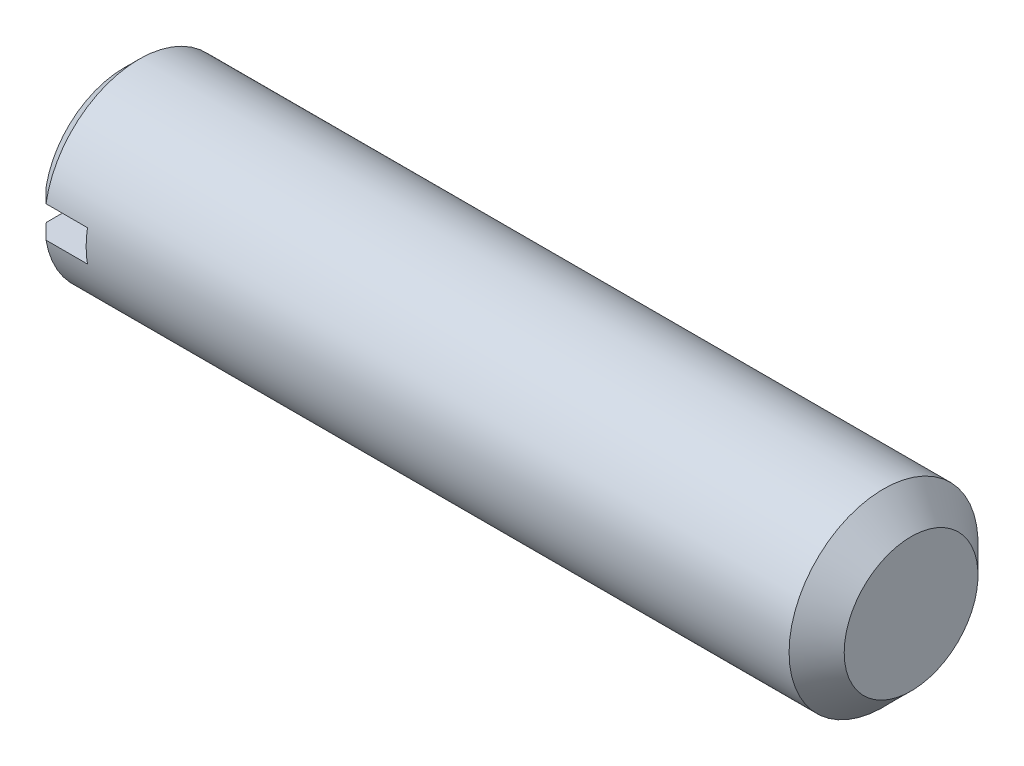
ISO-10303-21;
HEADER;
FILE_DESCRIPTION(('STEP AP214'),'2;1');
FILE_NAME('part.step','',(''),(''),'','','');
FILE_SCHEMA(('AUTOMOTIVE_DESIGN { 1 0 10303 214 1 1 1 1 }'));
ENDSEC;
DATA;
#1=APPLICATION_CONTEXT('core data for automotive mechanical design processes');
#2=APPLICATION_PROTOCOL_DEFINITION('international standard','automotive_design',2000,#1);
#3=PRODUCT_CONTEXT('',#1,'mechanical');
#4=PRODUCT('Part','Part','',(#3));
#5=PRODUCT_RELATED_PRODUCT_CATEGORY('part','',(#4));
#6=PRODUCT_DEFINITION_FORMATION('','',#4);
#7=PRODUCT_DEFINITION_CONTEXT('part definition',#1,'design');
#8=PRODUCT_DEFINITION('design','',#6,#7);
#9=PRODUCT_DEFINITION_SHAPE('','',#8);
#10=(LENGTH_UNIT() NAMED_UNIT(*) SI_UNIT(.MILLI.,.METRE.));
#11=(NAMED_UNIT(*) PLANE_ANGLE_UNIT() SI_UNIT($,.RADIAN.));
#12=(NAMED_UNIT(*) SI_UNIT($,.STERADIAN.) SOLID_ANGLE_UNIT());
#13=UNCERTAINTY_MEASURE_WITH_UNIT(LENGTH_MEASURE(1.E-05),#10,'distance_accuracy_value','');
#14=(GEOMETRIC_REPRESENTATION_CONTEXT(3) GLOBAL_UNCERTAINTY_ASSIGNED_CONTEXT((#13)) GLOBAL_UNIT_ASSIGNED_CONTEXT((#10,
#11,#12)) REPRESENTATION_CONTEXT('',''));
#15=CARTESIAN_POINT('',(0.,0.,0.));
#16=DIRECTION('',(0.,0.,1.));
#17=DIRECTION('',(1.,0.,0.));
#18=AXIS2_PLACEMENT_3D('',#15,#16,#17);
#19=CARTESIAN_POINT('',(0.,0.,0.));
#20=DIRECTION('',(1.,0.,0.));
#21=DIRECTION('',(0.,0.,-1.));
#22=AXIS2_PLACEMENT_3D('',#19,#20,#21);
#23=PLANE('',#22);
#24=DIRECTION('',(0.,0.,-1.));
#25=VECTOR('',#24,1.);
#26=CARTESIAN_POINT('',(0.,-1.,6.));
#27=LINE('',#26,#25);
#28=CARTESIAN_POINT('',(0.,-1.,4.93571636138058));
#29=VERTEX_POINT('',#28);
#30=CARTESIAN_POINT('',(0.,-1.,-4.93571636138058));
#31=VERTEX_POINT('',#30);
#32=EDGE_CURVE('E181',#29,#31,#27,.T.);
#33=ORIENTED_EDGE('',*,*,#32,.T.);
#34=CARTESIAN_POINT('',(0.,0.,0.));
#35=DIRECTION('',(-1.,0.,0.));
#36=DIRECTION('',(0.,0.,1.));
#37=AXIS2_PLACEMENT_3D('',#34,#35,#36);
#38=CIRCLE('',#37,5.036);
#39=EDGE_CURVE('E122',#31,#29,#38,.T.);
#40=ORIENTED_EDGE('',*,*,#39,.T.);
#41=EDGE_LOOP('',(#33,#40));
#42=FACE_BOUND('',#41,.T.);
#43=ADVANCED_FACE('F44',(#42),#23,.F.);
#44=DIRECTION('',(0.,0.,1.));
#45=VECTOR('',#44,1.);
#46=CARTESIAN_POINT('',(0.,1.,6.));
#47=LINE('',#46,#45);
#48=CARTESIAN_POINT('',(0.,1.,-4.93571636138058));
#49=VERTEX_POINT('',#48);
#50=CARTESIAN_POINT('',(0.,1.,4.93571636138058));
#51=VERTEX_POINT('',#50);
#52=EDGE_CURVE('E110',#49,#51,#47,.T.);
#53=ORIENTED_EDGE('',*,*,#52,.T.);
#54=EDGE_CURVE('E120',#51,#49,#38,.T.);
#55=ORIENTED_EDGE('',*,*,#54,.T.);
#56=EDGE_LOOP('',(#53,#55));
#57=FACE_BOUND('',#56,.T.);
#58=ADVANCED_FACE('F174',(#57),#23,.F.);
#59=CARTESIAN_POINT('',(0.964,0.,0.));
#60=DIRECTION('',(1.,0.,0.));
#61=DIRECTION('',(0.,0.,-1.));
#62=AXIS2_PLACEMENT_3D('',#59,#60,#61);
#63=CONICAL_SURFACE('',#62,6.,0.785398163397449);
#64=CARTESIAN_POINT('',(8.18739503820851,-1.,-13.185529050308));
#65=CARTESIAN_POINT('',(7.72173696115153,-1.,-12.71852199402));
#66=CARTESIAN_POINT('',(7.25613875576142,-1.,-12.2514551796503));
#67=CARTESIAN_POINT('',(6.32512700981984,-1.,-11.3171039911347));
#68=CARTESIAN_POINT('',(5.85971347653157,-1.,-10.8498196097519));
#69=CARTESIAN_POINT('',(4.92876157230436,-1.,-9.91455900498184));
#70=CARTESIAN_POINT('',(4.46322344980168,-1.,-9.44658253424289));
#71=CARTESIAN_POINT('',(3.53260322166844,-1.,-8.51020895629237));
#72=CARTESIAN_POINT('',(3.06752110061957,-1.,-8.04181186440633));
#73=CARTESIAN_POINT('',(2.15821966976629,-1.,-7.12462717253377));
#74=CARTESIAN_POINT('',(1.71396996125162,-1.,-6.67586973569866));
#75=CARTESIAN_POINT('',(1.04846409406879,-1.,-6.0018283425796));
#76=CARTESIAN_POINT('',(0.826761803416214,-1.,-5.77698500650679));
#77=CARTESIAN_POINT('',(0.383784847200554,-1.,-5.32688183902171));
#78=CARTESIAN_POINT('',(0.162510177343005,-1.,-5.10162201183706));
#79=CARTESIAN_POINT('',(-0.279302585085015,-1.,-4.65061661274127));
#80=CARTESIAN_POINT('',(-0.499841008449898,-1.,-4.42487136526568));
#81=CARTESIAN_POINT('',(-0.939964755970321,-1.,-3.97243637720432));
#82=CARTESIAN_POINT('',(-1.15955004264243,-1.,-3.74574660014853));
#83=CARTESIAN_POINT('',(-1.5971072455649,-1.,-3.29088888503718));
#84=CARTESIAN_POINT('',(-1.81507945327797,-1.,-3.06272122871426));
#85=CARTESIAN_POINT('',(-2.13978630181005,-1.,-2.71835823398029));
#86=CARTESIAN_POINT('',(-2.24764335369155,-1.,-2.60322226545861));
#87=CARTESIAN_POINT('',(-2.46225552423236,-1.,-2.37192883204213));
#88=CARTESIAN_POINT('',(-2.56901066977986,-1.,-2.25577139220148));
#89=CARTESIAN_POINT('',(-2.70433037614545,-1.,-2.10638744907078));
#90=CARTESIAN_POINT('',(-2.73367252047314,-1.,-2.07386514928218));
#91=CARTESIAN_POINT('',(-2.79220629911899,-1.,-2.00868525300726));
#92=CARTESIAN_POINT('',(-2.82139793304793,-1.,-1.97602765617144));
#93=CARTESIAN_POINT('',(-2.90872232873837,-1.,-1.8778206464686));
#94=CARTESIAN_POINT('',(-2.96659914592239,-1.,-1.81204300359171));
#95=CARTESIAN_POINT('',(-3.08184804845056,-1.,-1.67922857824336));
#96=CARTESIAN_POINT('',(-3.13921368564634,-1.,-1.61218618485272));
#97=CARTESIAN_POINT('',(-3.25265645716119,-1.,-1.4770460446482));
#98=CARTESIAN_POINT('',(-3.30873392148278,-1.,-1.40894857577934));
#99=CARTESIAN_POINT('',(-3.41951675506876,-1.,-1.27072673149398));
#100=CARTESIAN_POINT('',(-3.47420734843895,-1.,-1.20059041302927));
#101=CARTESIAN_POINT('',(-3.58078617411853,-1.,-1.05824293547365));
#102=CARTESIAN_POINT('',(-3.63267529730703,-1.,-0.986032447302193));
#103=CARTESIAN_POINT('',(-3.73179995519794,-1.,-0.838985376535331));
#104=CARTESIAN_POINT('',(-3.77906004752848,-1.,-0.764165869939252));
#105=CARTESIAN_POINT('',(-3.84435481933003,-1.,-0.648848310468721));
#106=CARTESIAN_POINT('',(-3.86516971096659,-1.,-0.609933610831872));
#107=CARTESIAN_POINT('',(-3.90433594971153,-1.,-0.530890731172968));
#108=CARTESIAN_POINT('',(-3.9226886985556,-1.,-0.490763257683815));
#109=CARTESIAN_POINT('',(-3.95198906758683,-1.,-0.419353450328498));
#110=CARTESIAN_POINT('',(-3.96364182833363,-1.,-0.388362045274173));
#111=CARTESIAN_POINT('',(-3.98473496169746,-1.,-0.325623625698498));
#112=CARTESIAN_POINT('',(-3.99417524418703,-1.,-0.293876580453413));
#113=CARTESIAN_POINT('',(-4.01039189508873,-1.,-0.229839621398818));
#114=CARTESIAN_POINT('',(-4.0171791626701,-1.,-0.197552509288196));
#115=CARTESIAN_POINT('',(-4.02777094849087,-1.,-0.13249483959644));
#116=CARTESIAN_POINT('',(-4.03157640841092,-1.,-0.0997244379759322));
#117=CARTESIAN_POINT('',(-4.03598217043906,-1.,-0.0336377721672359));
#118=CARTESIAN_POINT('',(-4.03655046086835,-1.,-0.00031931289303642));
#119=CARTESIAN_POINT('',(-4.03436475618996,-1.,0.0662003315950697));
#120=CARTESIAN_POINT('',(-4.03161072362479,-1.,0.0994015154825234));
#121=CARTESIAN_POINT('',(-4.01857837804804,-1.,0.198547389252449));
#122=CARTESIAN_POINT('',(-4.0035212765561,-1.,0.263890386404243));
#123=CARTESIAN_POINT('',(-3.96875276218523,-1.,0.375679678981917));
#124=CARTESIAN_POINT('',(-3.95109708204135,-1.,0.422820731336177));
#125=CARTESIAN_POINT('',(-3.91176267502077,-1.,0.515422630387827));
#126=CARTESIAN_POINT('',(-3.89008085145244,-1.,0.560882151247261));
#127=CARTESIAN_POINT('',(-3.8436818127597,-1.,0.650461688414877));
#128=CARTESIAN_POINT('',(-3.81895103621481,-1.,0.694574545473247));
#129=CARTESIAN_POINT('',(-3.76733867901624,-1.,0.78148630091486));
#130=CARTESIAN_POINT('',(-3.74045800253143,-1.,0.824285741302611));
#131=CARTESIAN_POINT('',(-3.6797749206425,-1.,0.916951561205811));
#132=CARTESIAN_POINT('',(-3.64563502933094,-1.,0.966595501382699));
#133=CARTESIAN_POINT('',(-3.57571102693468,-1.,1.06471636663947));
#134=CARTESIAN_POINT('',(-3.5399265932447,-1.,1.11319305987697));
#135=CARTESIAN_POINT('',(-3.43072910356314,-1.,1.25732593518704));
#136=CARTESIAN_POINT('',(-3.35551889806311,-1.,1.35161593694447));
#137=CARTESIAN_POINT('',(-3.20214571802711,-1.,1.53811640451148));
#138=CARTESIAN_POINT('',(-3.12397592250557,-1.,1.63032117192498));
#139=CARTESIAN_POINT('',(-2.96588212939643,-1.,1.81314430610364));
#140=CARTESIAN_POINT('',(-2.88595886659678,-1.,1.90376330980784));
#141=CARTESIAN_POINT('',(-2.72475343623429,-1.,2.08410427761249));
#142=CARTESIAN_POINT('',(-2.64346888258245,-1.,2.17382409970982));
#143=CARTESIAN_POINT('',(-2.48004111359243,-1.,2.35249375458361));
#144=CARTESIAN_POINT('',(-2.39789781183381,-1.,2.4414435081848));
#145=CARTESIAN_POINT('',(-2.23311792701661,-1.,2.61862662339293));
#146=CARTESIAN_POINT('',(-2.15048230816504,-1.,2.70686088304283));
#147=CARTESIAN_POINT('',(-1.98474580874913,-1.,2.88288512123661));
#148=CARTESIAN_POINT('',(-1.90164494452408,-1.,2.97067511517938));
#149=CARTESIAN_POINT('',(-1.6533619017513,-1.,3.23190010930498));
#150=CARTESIAN_POINT('',(-1.4876576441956,-1.,3.40483867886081));
#151=CARTESIAN_POINT('',(-1.15536226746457,-1.,3.749862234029));
#152=CARTESIAN_POINT('',(-0.988771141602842,-1.,3.92194721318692));
#153=CARTESIAN_POINT('',(-0.488104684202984,-1.,4.43735511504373));
#154=CARTESIAN_POINT('',(-0.153146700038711,-1.,4.7798201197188));
#155=CARTESIAN_POINT('',(0.518172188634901,-1.,5.46378768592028));
#156=CARTESIAN_POINT('',(0.854533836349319,-1.,5.80528951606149));
#157=CARTESIAN_POINT('',(1.52796905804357,-1.,6.48758005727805));
#158=CARTESIAN_POINT('',(1.8650426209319,-1.,6.82836877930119));
#159=CARTESIAN_POINT('',(2.53882709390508,-1.,7.50867429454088));
#160=CARTESIAN_POINT('',(2.87553691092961,-1.,7.84819217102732));
#161=CARTESIAN_POINT('',(3.54926455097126,-1.,8.52692488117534));
#162=CARTESIAN_POINT('',(3.88628237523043,-1.,8.86613971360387));
#163=CARTESIAN_POINT('',(4.89754654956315,-1.,9.88335866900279));
#164=CARTESIAN_POINT('',(5.57211148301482,-1.,10.5610460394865));
#165=CARTESIAN_POINT('',(6.40850112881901,-1.,11.4007367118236));
#166=CARTESIAN_POINT('',(6.57010906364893,-1.,11.5629560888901));
#167=CARTESIAN_POINT('',(6.89335366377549,-1.,11.8873745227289));
#168=CARTESIAN_POINT('',(7.0549903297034,-1.,12.0495735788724));
#169=CARTESIAN_POINT('',(7.37841272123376,-1.,12.3740784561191));
#170=CARTESIAN_POINT('',(7.54019846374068,-1.,12.5363842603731));
#171=CARTESIAN_POINT('',(7.86378498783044,-1.,12.8609725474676));
#172=CARTESIAN_POINT('',(8.02558576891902,-1.,13.0232550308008));
#173=CARTESIAN_POINT('',(8.18739503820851,-1.,13.185529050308));
#174=B_SPLINE_CURVE_WITH_KNOTS('',3,(#64,#65,#66,#67,#68,#69,#70,#71,#72,#73,#74,#75,#76,#77,
#78,#79,#80,#81,#82,#83,#84,#85,#86,#87,#88,#89,#90,#91,#92,#93,#94,#95,#96,#97,#98,#99,#100,
#101,#102,#103,#104,#105,#106,#107,#108,#109,#110,#111,#112,#113,#114,#115,#116,#117,#118,#119,
#120,#121,#122,#123,#124,#125,#126,#127,#128,#129,#130,#131,#132,#133,#134,#135,#136,#137,#138,
#139,#140,#141,#142,#143,#144,#145,#146,#147,#148,#149,#150,#151,#152,#153,#154,#155,#156,#157,
#158,#159,#160,#161,#162,#163,#164,#165,#166,#167,#168,#169,#170,#171,#172,#173),.UNSPECIFIED.,
.F.,.F.,(4,2,2,2,2,2,2,2,2,2,2,2,2,2,2,2,2,2,2,2,2,2,2,2,2,2,2,2,2,2,2,2,2,2,2,2,2,2,2,2,2,2,2,
2,2,2,2,2,2,2,2,2,2,2,4),(0.,1.97848364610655,3.95703862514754,5.93732867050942,
7.91754927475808,9.81192615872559,10.7592155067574,11.7064952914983,12.6532681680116,
13.6000779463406,14.546712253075,15.0199999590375,15.4932760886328,15.6246832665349,
15.7560907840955,16.0189300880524,16.2836250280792,16.5482513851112,16.8150192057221,
17.0817016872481,17.3468825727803,17.4792167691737,17.6114753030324,17.7107371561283,
17.8100030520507,17.9088567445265,18.007679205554,18.1074772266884,18.2072763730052,
18.4072998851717,18.5581246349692,18.7090658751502,18.8607045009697,19.012279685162,
19.1929820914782,19.3737200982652,19.7354462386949,20.0980639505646,20.4605325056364,
20.8237218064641,21.1869480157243,21.5496101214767,21.9122595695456,22.6307874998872,
23.3493208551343,24.7864327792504,26.2244388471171,27.6624226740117,29.0969303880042,
30.5314439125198,33.4000113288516,34.0869540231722,34.7739143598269,35.4614172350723,
36.148902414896),.UNSPECIFIED.);
#175=CARTESIAN_POINT('',(0.964,-1.,-5.91607978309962));
#176=VERTEX_POINT('',#175);
#177=EDGE_CURVE('E139',#176,#31,#174,.T.);
#178=ORIENTED_EDGE('',*,*,#177,.F.);
#179=CARTESIAN_POINT('',(0.964,0.,0.));
#180=DIRECTION('',(-1.,0.,0.));
#181=DIRECTION('',(0.,0.,1.));
#182=AXIS2_PLACEMENT_3D('',#179,#180,#181);
#183=CIRCLE('',#182,6.);
#184=CARTESIAN_POINT('',(0.964,-1.,5.91607978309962));
#185=VERTEX_POINT('',#184);
#186=EDGE_CURVE('E130',#176,#185,#183,.T.);
#187=ORIENTED_EDGE('',*,*,#186,.T.);
#188=EDGE_CURVE('E62',#29,#185,#174,.T.);
#189=ORIENTED_EDGE('',*,*,#188,.F.);
#190=ORIENTED_EDGE('',*,*,#39,.F.);
#191=EDGE_LOOP('',(#178,#187,#189,#190));
#192=FACE_BOUND('',#191,.T.);
#193=ADVANCED_FACE('F152',(#192),#63,.T.);
#194=CARTESIAN_POINT('',(8.18739503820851,1.,13.1855290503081));
#195=CARTESIAN_POINT('',(7.72173696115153,1.,12.71852199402));
#196=CARTESIAN_POINT('',(7.25613875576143,1.,12.2514551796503));
#197=CARTESIAN_POINT('',(6.32512700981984,1.,11.3171039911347));
#198=CARTESIAN_POINT('',(5.85971347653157,1.,10.8498196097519));
#199=CARTESIAN_POINT('',(4.92876157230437,1.,9.91455900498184));
#200=CARTESIAN_POINT('',(4.46322344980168,1.,9.44658253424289));
#201=CARTESIAN_POINT('',(3.53260322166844,1.,8.51020895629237));
#202=CARTESIAN_POINT('',(3.06752110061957,1.,8.04181186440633));
#203=CARTESIAN_POINT('',(2.15821966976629,1.,7.12462717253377));
#204=CARTESIAN_POINT('',(1.71396996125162,1.,6.67586973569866));
#205=CARTESIAN_POINT('',(1.04846409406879,1.,6.00182834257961));
#206=CARTESIAN_POINT('',(0.826761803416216,1.,5.77698500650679));
#207=CARTESIAN_POINT('',(0.383784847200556,1.,5.32688183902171));
#208=CARTESIAN_POINT('',(0.162510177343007,1.,5.10162201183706));
#209=CARTESIAN_POINT('',(-0.279302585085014,1.,4.65061661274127));
#210=CARTESIAN_POINT('',(-0.499841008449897,1.,4.42487136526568));
#211=CARTESIAN_POINT('',(-0.939964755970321,1.,3.97243637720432));
#212=CARTESIAN_POINT('',(-1.15955004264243,1.,3.74574660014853));
#213=CARTESIAN_POINT('',(-1.59710724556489,1.,3.29088888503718));
#214=CARTESIAN_POINT('',(-1.81507945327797,1.,3.06272122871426));
#215=CARTESIAN_POINT('',(-2.13978630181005,1.,2.71835823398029));
#216=CARTESIAN_POINT('',(-2.24764335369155,1.,2.60322226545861));
#217=CARTESIAN_POINT('',(-2.46225552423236,1.,2.37192883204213));
#218=CARTESIAN_POINT('',(-2.56901066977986,1.,2.25577139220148));
#219=CARTESIAN_POINT('',(-2.70433037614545,1.,2.10638744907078));
#220=CARTESIAN_POINT('',(-2.73367252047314,1.,2.07386514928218));
#221=CARTESIAN_POINT('',(-2.792206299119,1.,2.00868525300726));
#222=CARTESIAN_POINT('',(-2.82139793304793,1.,1.97602765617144));
#223=CARTESIAN_POINT('',(-2.90872232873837,1.,1.8778206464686));
#224=CARTESIAN_POINT('',(-2.96659914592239,1.,1.81204300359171));
#225=CARTESIAN_POINT('',(-3.08184804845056,1.,1.67922857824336));
#226=CARTESIAN_POINT('',(-3.13921368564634,1.,1.61218618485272));
#227=CARTESIAN_POINT('',(-3.25265645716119,1.,1.4770460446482));
#228=CARTESIAN_POINT('',(-3.30873392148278,1.,1.40894857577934));
#229=CARTESIAN_POINT('',(-3.41951675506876,1.,1.27072673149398));
#230=CARTESIAN_POINT('',(-3.47420734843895,1.,1.20059041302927));
#231=CARTESIAN_POINT('',(-3.58078617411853,1.,1.05824293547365));
#232=CARTESIAN_POINT('',(-3.63267529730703,1.,0.986032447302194));
#233=CARTESIAN_POINT('',(-3.73179995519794,1.,0.838985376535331));
#234=CARTESIAN_POINT('',(-3.77906004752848,1.,0.764165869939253));
#235=CARTESIAN_POINT('',(-3.84435481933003,1.,0.648848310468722));
#236=CARTESIAN_POINT('',(-3.86516971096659,1.,0.609933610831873));
#237=CARTESIAN_POINT('',(-3.90433594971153,1.,0.530890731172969));
#238=CARTESIAN_POINT('',(-3.9226886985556,1.,0.490763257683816));
#239=CARTESIAN_POINT('',(-3.95198906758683,1.,0.419353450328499));
#240=CARTESIAN_POINT('',(-3.96364182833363,1.,0.388362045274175));
#241=CARTESIAN_POINT('',(-3.98473496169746,1.,0.325623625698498));
#242=CARTESIAN_POINT('',(-3.99417524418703,1.,0.293876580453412));
#243=CARTESIAN_POINT('',(-4.01039189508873,1.,0.229839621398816));
#244=CARTESIAN_POINT('',(-4.0171791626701,1.,0.197552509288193));
#245=CARTESIAN_POINT('',(-4.02777094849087,1.,0.132494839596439));
#246=CARTESIAN_POINT('',(-4.03157640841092,1.,0.0997244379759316));
#247=CARTESIAN_POINT('',(-4.03598217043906,1.,0.0336377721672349));
#248=CARTESIAN_POINT('',(-4.03655046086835,1.,0.000319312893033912));
#249=CARTESIAN_POINT('',(-4.03436475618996,1.,-0.066200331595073));
#250=CARTESIAN_POINT('',(-4.03161072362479,1.,-0.0994015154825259));
#251=CARTESIAN_POINT('',(-4.01857837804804,1.,-0.19854738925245));
#252=CARTESIAN_POINT('',(-4.0035212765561,1.,-0.263890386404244));
#253=CARTESIAN_POINT('',(-3.96875276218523,1.,-0.375679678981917));
#254=CARTESIAN_POINT('',(-3.95109708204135,1.,-0.422820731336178));
#255=CARTESIAN_POINT('',(-3.91176267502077,1.,-0.515422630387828));
#256=CARTESIAN_POINT('',(-3.89008085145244,1.,-0.560882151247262));
#257=CARTESIAN_POINT('',(-3.8436818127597,1.,-0.650461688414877));
#258=CARTESIAN_POINT('',(-3.81895103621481,1.,-0.694574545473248));
#259=CARTESIAN_POINT('',(-3.76733867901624,1.,-0.78148630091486));
#260=CARTESIAN_POINT('',(-3.74045800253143,1.,-0.824285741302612));
#261=CARTESIAN_POINT('',(-3.6797749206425,1.,-0.916951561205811));
#262=CARTESIAN_POINT('',(-3.64563502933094,1.,-0.9665955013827));
#263=CARTESIAN_POINT('',(-3.57571102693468,1.,-1.06471636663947));
#264=CARTESIAN_POINT('',(-3.5399265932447,1.,-1.11319305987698));
#265=CARTESIAN_POINT('',(-3.43072910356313,1.,-1.25732593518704));
#266=CARTESIAN_POINT('',(-3.35551889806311,1.,-1.35161593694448));
#267=CARTESIAN_POINT('',(-3.2021457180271,1.,-1.53811640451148));
#268=CARTESIAN_POINT('',(-3.12397592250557,1.,-1.63032117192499));
#269=CARTESIAN_POINT('',(-2.96588212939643,1.,-1.81314430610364));
#270=CARTESIAN_POINT('',(-2.88595886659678,1.,-1.90376330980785));
#271=CARTESIAN_POINT('',(-2.72475343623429,1.,-2.08410427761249));
#272=CARTESIAN_POINT('',(-2.64346888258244,1.,-2.17382409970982));
#273=CARTESIAN_POINT('',(-2.48004111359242,1.,-2.35249375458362));
#274=CARTESIAN_POINT('',(-2.39789781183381,1.,-2.44144350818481));
#275=CARTESIAN_POINT('',(-2.2331179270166,1.,-2.61862662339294));
#276=CARTESIAN_POINT('',(-2.15048230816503,1.,-2.70686088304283));
#277=CARTESIAN_POINT('',(-1.98474580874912,1.,-2.88288512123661));
#278=CARTESIAN_POINT('',(-1.90164494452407,1.,-2.97067511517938));
#279=CARTESIAN_POINT('',(-1.6533619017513,1.,-3.23190010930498));
#280=CARTESIAN_POINT('',(-1.4876576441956,1.,-3.40483867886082));
#281=CARTESIAN_POINT('',(-1.15536226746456,1.,-3.74986223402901));
#282=CARTESIAN_POINT('',(-0.988771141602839,1.,-3.92194721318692));
#283=CARTESIAN_POINT('',(-0.488104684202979,1.,-4.43735511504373));
#284=CARTESIAN_POINT('',(-0.153146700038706,1.,-4.7798201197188));
#285=CARTESIAN_POINT('',(0.518172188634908,1.,-5.46378768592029));
#286=CARTESIAN_POINT('',(0.854533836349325,1.,-5.8052895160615));
#287=CARTESIAN_POINT('',(1.52796905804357,1.,-6.48758005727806));
#288=CARTESIAN_POINT('',(1.86504262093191,1.,-6.8283687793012));
#289=CARTESIAN_POINT('',(2.53882709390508,1.,-7.50867429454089));
#290=CARTESIAN_POINT('',(2.87553691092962,1.,-7.84819217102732));
#291=CARTESIAN_POINT('',(3.54926455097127,1.,-8.52692488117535));
#292=CARTESIAN_POINT('',(3.88628237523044,1.,-8.86613971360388));
#293=CARTESIAN_POINT('',(4.89754654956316,1.,-9.88335866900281));
#294=CARTESIAN_POINT('',(5.57211148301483,1.,-10.5610460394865));
#295=CARTESIAN_POINT('',(6.40850112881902,1.,-11.4007367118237));
#296=CARTESIAN_POINT('',(6.57010906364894,1.,-11.5629560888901));
#297=CARTESIAN_POINT('',(6.8933536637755,1.,-11.8873745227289));
#298=CARTESIAN_POINT('',(7.05499032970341,1.,-12.0495735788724));
#299=CARTESIAN_POINT('',(7.37841272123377,1.,-12.3740784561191));
#300=CARTESIAN_POINT('',(7.54019846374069,1.,-12.5363842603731));
#301=CARTESIAN_POINT('',(7.86378498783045,1.,-12.8609725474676));
#302=CARTESIAN_POINT('',(8.02558576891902,1.,-13.0232550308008));
#303=CARTESIAN_POINT('',(8.18739503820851,1.,-13.1855290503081));
#304=B_SPLINE_CURVE_WITH_KNOTS('',3,(#194,#195,#196,#197,#198,#199,#200,#201,#202,#203,#204,
#205,#206,#207,#208,#209,#210,#211,#212,#213,#214,#215,#216,#217,#218,#219,#220,#221,#222,#223,
#224,#225,#226,#227,#228,#229,#230,#231,#232,#233,#234,#235,#236,#237,#238,#239,#240,#241,#242,
#243,#244,#245,#246,#247,#248,#249,#250,#251,#252,#253,#254,#255,#256,#257,#258,#259,#260,#261,
#262,#263,#264,#265,#266,#267,#268,#269,#270,#271,#272,#273,#274,#275,#276,#277,#278,#279,#280,
#281,#282,#283,#284,#285,#286,#287,#288,#289,#290,#291,#292,#293,#294,#295,#296,#297,#298,#299,
#300,#301,#302,#303),.UNSPECIFIED.,.F.,.F.,(4,2,2,2,2,2,2,2,2,2,2,2,2,2,2,2,2,2,2,2,2,2,2,2,2,2,
2,2,2,2,2,2,2,2,2,2,2,2,2,2,2,2,2,2,2,2,2,2,2,2,2,2,2,2,4),(0.,1.97848364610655,
3.95703862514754,5.93732867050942,7.91754927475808,9.81192615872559,10.7592155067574,
11.7064952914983,12.6532681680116,13.6000779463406,14.546712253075,15.0199999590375,
15.4932760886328,15.6246832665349,15.7560907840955,16.0189300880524,16.2836250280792,
16.5482513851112,16.8150192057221,17.0817016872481,17.3468825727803,17.4792167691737,
17.6114753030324,17.7107371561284,17.8100030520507,17.9088567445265,18.007679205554,
18.1074772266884,18.2072763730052,18.4072998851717,18.5581246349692,18.7090658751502,
18.8607045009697,19.012279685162,19.1929820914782,19.3737200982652,19.7354462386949,
20.0980639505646,20.4605325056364,20.8237218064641,21.1869480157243,21.5496101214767,
21.9122595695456,22.6307874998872,23.3493208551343,24.7864327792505,26.2244388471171,
27.6624226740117,29.0969303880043,30.5314439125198,33.4000113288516,34.0869540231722,
34.7739143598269,35.4614172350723,36.148902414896),.UNSPECIFIED.);
#305=CARTESIAN_POINT('',(0.964,1.,5.91607978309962));
#306=VERTEX_POINT('',#305);
#307=EDGE_CURVE('E141',#306,#51,#304,.T.);
#308=ORIENTED_EDGE('',*,*,#307,.F.);
#309=CARTESIAN_POINT('',(0.964,1.,-5.91607978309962));
#310=VERTEX_POINT('',#309);
#311=EDGE_CURVE('E129',#306,#310,#183,.T.);
#312=ORIENTED_EDGE('',*,*,#311,.T.);
#313=EDGE_CURVE('E144',#49,#310,#304,.T.);
#314=ORIENTED_EDGE('',*,*,#313,.F.);
#315=ORIENTED_EDGE('',*,*,#54,.F.);
#316=EDGE_LOOP('',(#308,#312,#314,#315));
#317=FACE_BOUND('',#316,.T.);
#318=ADVANCED_FACE('F166',(#317),#63,.T.);
#319=CARTESIAN_POINT('',(0.,0.,0.));
#320=DIRECTION('',(-1.,0.,0.));
#321=DIRECTION('',(0.,0.,1.));
#322=AXIS2_PLACEMENT_3D('',#319,#320,#321);
#323=CYLINDRICAL_SURFACE('',#322,6.);
#324=CARTESIAN_POINT('',(48.25,0.,0.));
#325=DIRECTION('',(-1.,0.,0.));
#326=DIRECTION('',(0.,0.,1.));
#327=AXIS2_PLACEMENT_3D('',#324,#325,#326);
#328=CIRCLE('',#327,6.);
#329=CARTESIAN_POINT('',(48.25,0.,6.));
#330=VERTEX_POINT('',#329);
#331=EDGE_CURVE('E127',#330,#330,#328,.T.);
#332=ORIENTED_EDGE('',*,*,#331,.T.);
#333=EDGE_LOOP('',(#332));
#334=FACE_BOUND('',#333,.T.);
#335=DIRECTION('',(-1.,0.,0.));
#336=VECTOR('',#335,1.);
#337=CARTESIAN_POINT('',(0.,-1.,5.91607978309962));
#338=LINE('',#337,#336);
#339=CARTESIAN_POINT('',(3.6,-1.,5.91607978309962));
#340=VERTEX_POINT('',#339);
#341=EDGE_CURVE('E11',#185,#340,#338,.F.);
#342=ORIENTED_EDGE('',*,*,#341,.F.);
#343=ORIENTED_EDGE('',*,*,#186,.F.);
#344=DIRECTION('',(-1.,0.,0.));
#345=VECTOR('',#344,1.);
#346=CARTESIAN_POINT('',(0.,-1.,-5.91607978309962));
#347=LINE('',#346,#345);
#348=CARTESIAN_POINT('',(3.6,-1.,-5.91607978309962));
#349=VERTEX_POINT('',#348);
#350=EDGE_CURVE('E56',#349,#176,#347,.T.);
#351=ORIENTED_EDGE('',*,*,#350,.F.);
#352=CARTESIAN_POINT('',(3.6,0.,0.));
#353=DIRECTION('',(1.,0.,0.));
#354=DIRECTION('',(0.,0.,-1.));
#355=AXIS2_PLACEMENT_3D('',#352,#353,#354);
#356=CIRCLE('',#355,6.);
#357=CARTESIAN_POINT('',(3.6,1.,-5.91607978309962));
#358=VERTEX_POINT('',#357);
#359=EDGE_CURVE('E102',#349,#358,#356,.T.);
#360=ORIENTED_EDGE('',*,*,#359,.T.);
#361=DIRECTION('',(-1.,0.,0.));
#362=VECTOR('',#361,1.);
#363=CARTESIAN_POINT('',(0.,1.,-5.91607978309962));
#364=LINE('',#363,#362);
#365=EDGE_CURVE('E113',#310,#358,#364,.F.);
#366=ORIENTED_EDGE('',*,*,#365,.F.);
#367=ORIENTED_EDGE('',*,*,#311,.F.);
#368=DIRECTION('',(-1.,0.,0.));
#369=VECTOR('',#368,1.);
#370=CARTESIAN_POINT('',(0.,1.,5.91607978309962));
#371=LINE('',#370,#369);
#372=CARTESIAN_POINT('',(3.6,1.,5.91607978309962));
#373=VERTEX_POINT('',#372);
#374=EDGE_CURVE('E55',#373,#306,#371,.T.);
#375=ORIENTED_EDGE('',*,*,#374,.F.);
#376=EDGE_CURVE('E101',#373,#340,#356,.T.);
#377=ORIENTED_EDGE('',*,*,#376,.T.);
#378=EDGE_LOOP('',(#342,#343,#351,#360,#366,#367,#375,#377));
#379=FACE_BOUND('',#378,.T.);
#380=ADVANCED_FACE('F109',(#334,#379),#323,.T.);
#381=CARTESIAN_POINT('',(50.,0.,0.));
#382=DIRECTION('',(-1.,0.,0.));
#383=DIRECTION('',(0.,0.,1.));
#384=AXIS2_PLACEMENT_3D('',#381,#382,#383);
#385=CONICAL_SURFACE('',#384,4.25,0.785398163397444);
#386=ORIENTED_EDGE('',*,*,#331,.F.);
#387=EDGE_LOOP('',(#386));
#388=FACE_BOUND('',#387,.T.);
#389=CARTESIAN_POINT('',(50.,0.,0.));
#390=DIRECTION('',(-1.,0.,0.));
#391=DIRECTION('',(0.,0.,1.));
#392=AXIS2_PLACEMENT_3D('',#389,#390,#391);
#393=CIRCLE('',#392,4.25);
#394=CARTESIAN_POINT('',(50.,0.,4.25));
#395=VERTEX_POINT('',#394);
#396=EDGE_CURVE('E133',#395,#395,#393,.T.);
#397=ORIENTED_EDGE('',*,*,#396,.T.);
#398=EDGE_LOOP('',(#397));
#399=FACE_BOUND('',#398,.T.);
#400=ADVANCED_FACE('F161',(#388,#399),#385,.T.);
#401=CARTESIAN_POINT('',(50.,4.25,0.));
#402=DIRECTION('',(-1.,0.,0.));
#403=DIRECTION('',(0.,0.,1.));
#404=AXIS2_PLACEMENT_3D('',#401,#402,#403);
#405=PLANE('',#404);
#406=ORIENTED_EDGE('',*,*,#396,.F.);
#407=EDGE_LOOP('',(#406));
#408=FACE_BOUND('',#407,.T.);
#409=ADVANCED_FACE('F160',(#408),#405,.F.);
#410=CARTESIAN_POINT('',(3.6,-1.,6.));
#411=DIRECTION('',(0.,1.,0.));
#412=DIRECTION('',(0.,0.,1.));
#413=AXIS2_PLACEMENT_3D('',#410,#411,#412);
#414=PLANE('',#413);
#415=ORIENTED_EDGE('',*,*,#177,.T.);
#416=ORIENTED_EDGE('',*,*,#32,.F.);
#417=ORIENTED_EDGE('',*,*,#188,.T.);
#418=ORIENTED_EDGE('',*,*,#341,.T.);
#419=DIRECTION('',(0.,0.,-1.));
#420=VECTOR('',#419,1.);
#421=CARTESIAN_POINT('',(3.6,-1.,6.));
#422=LINE('',#421,#420);
#423=EDGE_CURVE('E92',#340,#349,#422,.T.);
#424=ORIENTED_EDGE('',*,*,#423,.T.);
#425=ORIENTED_EDGE('',*,*,#350,.T.);
#426=EDGE_LOOP('',(#415,#416,#417,#418,#424,#425));
#427=FACE_BOUND('',#426,.T.);
#428=ADVANCED_FACE('F93',(#427),#414,.T.);
#429=CARTESIAN_POINT('',(3.6,1.,6.));
#430=DIRECTION('',(0.,-1.,0.));
#431=DIRECTION('',(0.,0.,-1.));
#432=AXIS2_PLACEMENT_3D('',#429,#430,#431);
#433=PLANE('',#432);
#434=ORIENTED_EDGE('',*,*,#307,.T.);
#435=ORIENTED_EDGE('',*,*,#52,.F.);
#436=ORIENTED_EDGE('',*,*,#313,.T.);
#437=ORIENTED_EDGE('',*,*,#365,.T.);
#438=DIRECTION('',(0.,0.,1.));
#439=VECTOR('',#438,1.);
#440=CARTESIAN_POINT('',(3.6,1.,6.));
#441=LINE('',#440,#439);
#442=EDGE_CURVE('E106',#358,#373,#441,.T.);
#443=ORIENTED_EDGE('',*,*,#442,.T.);
#444=ORIENTED_EDGE('',*,*,#374,.T.);
#445=EDGE_LOOP('',(#434,#435,#436,#437,#443,#444));
#446=FACE_BOUND('',#445,.T.);
#447=ADVANCED_FACE('F156',(#446),#433,.T.);
#448=CARTESIAN_POINT('',(3.6,-1.,6.));
#449=DIRECTION('',(1.,0.,0.));
#450=DIRECTION('',(0.,0.,-1.));
#451=AXIS2_PLACEMENT_3D('',#448,#449,#450);
#452=PLANE('',#451);
#453=ORIENTED_EDGE('',*,*,#442,.F.);
#454=ORIENTED_EDGE('',*,*,#359,.F.);
#455=ORIENTED_EDGE('',*,*,#423,.F.);
#456=ORIENTED_EDGE('',*,*,#376,.F.);
#457=EDGE_LOOP('',(#453,#454,#455,#456));
#458=FACE_BOUND('',#457,.T.);
#459=ADVANCED_FACE('F105',(#458),#452,.F.);
#460=CLOSED_SHELL('',(#43,#58,#193,#318,#380,#400,#409,#428,#447,#459));
#461=MANIFOLD_SOLID_BREP('B2',#460);
#462=ADVANCED_BREP_SHAPE_REPRESENTATION('',(#18,#461),#14);
#463=SHAPE_DEFINITION_REPRESENTATION(#9,#462);
ENDSEC;
END-ISO-10303-21;
